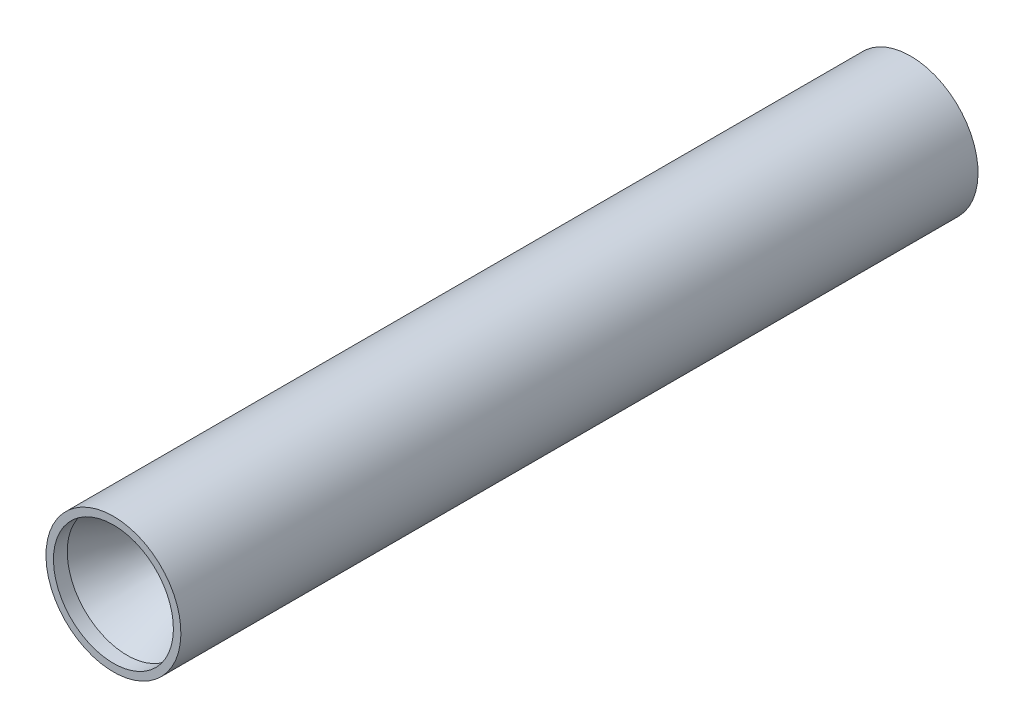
ISO-10303-21;
HEADER;
FILE_DESCRIPTION(('STEP AP214'),'2;1');
FILE_NAME('part.step','',(''),(''),'','','');
FILE_SCHEMA(('AUTOMOTIVE_DESIGN { 1 0 10303 214 1 1 1 1 }'));
ENDSEC;
DATA;
#1=APPLICATION_CONTEXT('core data for automotive mechanical design processes');
#2=APPLICATION_PROTOCOL_DEFINITION('international standard','automotive_design',2000,#1);
#3=PRODUCT_CONTEXT('',#1,'mechanical');
#4=PRODUCT('Part','Part','',(#3));
#5=PRODUCT_RELATED_PRODUCT_CATEGORY('part','',(#4));
#6=PRODUCT_DEFINITION_FORMATION('','',#4);
#7=PRODUCT_DEFINITION_CONTEXT('part definition',#1,'design');
#8=PRODUCT_DEFINITION('design','',#6,#7);
#9=PRODUCT_DEFINITION_SHAPE('','',#8);
#10=(LENGTH_UNIT() NAMED_UNIT(*) SI_UNIT(.MILLI.,.METRE.));
#11=(NAMED_UNIT(*) PLANE_ANGLE_UNIT() SI_UNIT($,.RADIAN.));
#12=(NAMED_UNIT(*) SI_UNIT($,.STERADIAN.) SOLID_ANGLE_UNIT());
#13=UNCERTAINTY_MEASURE_WITH_UNIT(LENGTH_MEASURE(1.E-05),#10,'distance_accuracy_value','');
#14=(GEOMETRIC_REPRESENTATION_CONTEXT(3) GLOBAL_UNCERTAINTY_ASSIGNED_CONTEXT((#13)) GLOBAL_UNIT_ASSIGNED_CONTEXT((#10,
#11,#12)) REPRESENTATION_CONTEXT('',''));
#15=CARTESIAN_POINT('',(0.,0.,0.));
#16=DIRECTION('',(0.,0.,1.));
#17=DIRECTION('',(1.,0.,0.));
#18=AXIS2_PLACEMENT_3D('',#15,#16,#17);
#19=CARTESIAN_POINT('',(0.,43.555023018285,289.5));
#20=DIRECTION('',(0.,0.,1.));
#21=DIRECTION('',(0.,-1.,0.));
#22=AXIS2_PLACEMENT_3D('',#19,#20,#21);
#23=PLANE('',#22);
#24=CARTESIAN_POINT('',(0.,0.,289.5));
#25=DIRECTION('',(0.,0.,-1.));
#26=DIRECTION('',(0.,1.,0.));
#27=AXIS2_PLACEMENT_3D('',#24,#25,#26);
#28=CIRCLE('',#27,43.555023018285);
#29=CARTESIAN_POINT('',(0.,43.555023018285,289.5));
#30=VERTEX_POINT('',#29);
#31=EDGE_CURVE('E75',#30,#30,#28,.T.);
#32=ORIENTED_EDGE('',*,*,#31,.T.);
#33=EDGE_LOOP('',(#32));
#34=FACE_BOUND('',#33,.T.);
#35=CARTESIAN_POINT('',(0.,0.,289.5));
#36=DIRECTION('',(0.,0.,-1.));
#37=DIRECTION('',(0.,1.,0.));
#38=AXIS2_PLACEMENT_3D('',#35,#36,#37);
#39=CIRCLE('',#38,49.);
#40=CARTESIAN_POINT('',(0.,49.,289.5));
#41=VERTEX_POINT('',#40);
#42=EDGE_CURVE('E10',#41,#41,#39,.T.);
#43=ORIENTED_EDGE('',*,*,#42,.F.);
#44=EDGE_LOOP('',(#43));
#45=FACE_BOUND('',#44,.T.);
#46=ADVANCED_FACE('F35',(#34,#45),#23,.T.);
#47=CARTESIAN_POINT('',(0.,0.,-279.5));
#48=DIRECTION('',(0.,0.,-1.));
#49=DIRECTION('',(0.,1.,0.));
#50=AXIS2_PLACEMENT_3D('',#47,#48,#49);
#51=CYLINDRICAL_SURFACE('',#50,49.);
#52=ORIENTED_EDGE('',*,*,#42,.T.);
#53=EDGE_LOOP('',(#52));
#54=FACE_BOUND('',#53,.T.);
#55=CARTESIAN_POINT('',(0.,0.,-289.5));
#56=DIRECTION('',(0.,0.,-1.));
#57=DIRECTION('',(0.,1.,0.));
#58=AXIS2_PLACEMENT_3D('',#55,#56,#57);
#59=CIRCLE('',#58,48.9999999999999);
#60=CARTESIAN_POINT('',(0.,49.,-289.5));
#61=VERTEX_POINT('',#60);
#62=EDGE_CURVE('E41',#61,#61,#59,.T.);
#63=ORIENTED_EDGE('',*,*,#62,.F.);
#64=EDGE_LOOP('',(#63));
#65=FACE_BOUND('',#64,.T.);
#66=ADVANCED_FACE('F93',(#54,#65),#51,.T.);
#67=CARTESIAN_POINT('',(0.,49.,-289.5));
#68=DIRECTION('',(0.,0.,-1.));
#69=DIRECTION('',(0.,1.,0.));
#70=AXIS2_PLACEMENT_3D('',#67,#68,#69);
#71=PLANE('',#70);
#72=ORIENTED_EDGE('',*,*,#62,.T.);
#73=EDGE_LOOP('',(#72));
#74=FACE_BOUND('',#73,.T.);
#75=CARTESIAN_POINT('',(0.,0.,-289.5));
#76=DIRECTION('',(0.,0.,-1.));
#77=DIRECTION('',(0.,1.,0.));
#78=AXIS2_PLACEMENT_3D('',#75,#76,#77);
#79=CIRCLE('',#78,10.);
#80=CARTESIAN_POINT('',(0.,10.0000000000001,-289.5));
#81=VERTEX_POINT('',#80);
#82=EDGE_CURVE('E45',#81,#81,#79,.T.);
#83=ORIENTED_EDGE('',*,*,#82,.F.);
#84=EDGE_LOOP('',(#83));
#85=FACE_BOUND('',#84,.T.);
#86=ADVANCED_FACE('F97',(#74,#85),#71,.T.);
#87=CARTESIAN_POINT('',(0.,0.,-279.5));
#88=DIRECTION('',(0.,0.,-1.));
#89=DIRECTION('',(0.,1.,0.));
#90=AXIS2_PLACEMENT_3D('',#87,#88,#89);
#91=CYLINDRICAL_SURFACE('',#90,10.);
#92=ORIENTED_EDGE('',*,*,#82,.T.);
#93=EDGE_LOOP('',(#92));
#94=FACE_BOUND('',#93,.T.);
#95=CARTESIAN_POINT('',(0.,0.,-279.5));
#96=DIRECTION('',(0.,0.,-1.));
#97=DIRECTION('',(0.,1.,0.));
#98=AXIS2_PLACEMENT_3D('',#95,#96,#97);
#99=CIRCLE('',#98,10.);
#100=CARTESIAN_POINT('',(0.,10.0000000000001,-279.5));
#101=VERTEX_POINT('',#100);
#102=EDGE_CURVE('E49',#101,#101,#99,.T.);
#103=ORIENTED_EDGE('',*,*,#102,.F.);
#104=EDGE_LOOP('',(#103));
#105=FACE_BOUND('',#104,.T.);
#106=ADVANCED_FACE('F101',(#94,#105),#91,.F.);
#107=CARTESIAN_POINT('',(0.,10.0000000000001,-279.5));
#108=DIRECTION('',(0.,0.,-1.));
#109=DIRECTION('',(0.,1.,0.));
#110=AXIS2_PLACEMENT_3D('',#107,#108,#109);
#111=PLANE('',#110);
#112=ORIENTED_EDGE('',*,*,#102,.T.);
#113=EDGE_LOOP('',(#112));
#114=FACE_BOUND('',#113,.T.);
#115=ADVANCED_FACE('F107',(#114),#111,.T.);
#116=CARTESIAN_POINT('',(0.,0.,-264.5));
#117=DIRECTION('',(0.,0.,1.));
#118=DIRECTION('',(0.,-1.,0.));
#119=AXIS2_PLACEMENT_3D('',#116,#117,#118);
#120=PLANE('',#119);
#121=CARTESIAN_POINT('',(0.,0.,-264.5));
#122=DIRECTION('',(0.,0.,-1.));
#123=DIRECTION('',(0.,1.,0.));
#124=AXIS2_PLACEMENT_3D('',#121,#122,#123);
#125=CIRCLE('',#124,35.2499999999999);
#126=CARTESIAN_POINT('',(0.,35.25,-264.5));
#127=VERTEX_POINT('',#126);
#128=EDGE_CURVE('E54',#127,#127,#125,.T.);
#129=ORIENTED_EDGE('',*,*,#128,.F.);
#130=EDGE_LOOP('',(#129));
#131=FACE_BOUND('',#130,.T.);
#132=ADVANCED_FACE('F111',(#131),#120,.T.);
#133=CARTESIAN_POINT('',(0.,0.,-279.5));
#134=DIRECTION('',(0.,0.,-1.));
#135=DIRECTION('',(0.,1.,0.));
#136=AXIS2_PLACEMENT_3D('',#133,#134,#135);
#137=CYLINDRICAL_SURFACE('',#136,35.2499999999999);
#138=ORIENTED_EDGE('',*,*,#128,.T.);
#139=EDGE_LOOP('',(#138));
#140=FACE_BOUND('',#139,.T.);
#141=CARTESIAN_POINT('',(0.,0.,169.5));
#142=DIRECTION('',(0.,0.,-1.));
#143=DIRECTION('',(0.,1.,0.));
#144=AXIS2_PLACEMENT_3D('',#141,#142,#143);
#145=CIRCLE('',#144,35.2499999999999);
#146=CARTESIAN_POINT('',(0.,35.2499999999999,169.5));
#147=VERTEX_POINT('',#146);
#148=EDGE_CURVE('E57',#147,#147,#145,.T.);
#149=ORIENTED_EDGE('',*,*,#148,.F.);
#150=EDGE_LOOP('',(#149));
#151=FACE_BOUND('',#150,.T.);
#152=ADVANCED_FACE('F115',(#140,#151),#137,.F.);
#153=CARTESIAN_POINT('',(0.,35.2499999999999,169.5));
#154=DIRECTION('',(0.,0.,1.));
#155=DIRECTION('',(0.,-1.,0.));
#156=AXIS2_PLACEMENT_3D('',#153,#154,#155);
#157=PLANE('',#156);
#158=ORIENTED_EDGE('',*,*,#148,.T.);
#159=EDGE_LOOP('',(#158));
#160=FACE_BOUND('',#159,.T.);
#161=CARTESIAN_POINT('',(0.,0.,169.5));
#162=DIRECTION('',(0.,0.,-1.));
#163=DIRECTION('',(0.,1.,0.));
#164=AXIS2_PLACEMENT_3D('',#161,#162,#163);
#165=CIRCLE('',#164,39.);
#166=CARTESIAN_POINT('',(0.,39.,169.5));
#167=VERTEX_POINT('',#166);
#168=EDGE_CURVE('E60',#167,#167,#165,.T.);
#169=ORIENTED_EDGE('',*,*,#168,.F.);
#170=EDGE_LOOP('',(#169));
#171=FACE_BOUND('',#170,.T.);
#172=ADVANCED_FACE('F119',(#160,#171),#157,.T.);
#173=CARTESIAN_POINT('',(0.,0.,-279.5));
#174=DIRECTION('',(0.,0.,-1.));
#175=DIRECTION('',(0.,1.,0.));
#176=AXIS2_PLACEMENT_3D('',#173,#174,#175);
#177=CYLINDRICAL_SURFACE('',#176,39.);
#178=ORIENTED_EDGE('',*,*,#168,.T.);
#179=EDGE_LOOP('',(#178));
#180=FACE_BOUND('',#179,.T.);
#181=CARTESIAN_POINT('',(0.,0.,179.5));
#182=DIRECTION('',(0.,0.,-1.));
#183=DIRECTION('',(0.,1.,0.));
#184=AXIS2_PLACEMENT_3D('',#181,#182,#183);
#185=CIRCLE('',#184,39.);
#186=CARTESIAN_POINT('',(0.,39.,179.5));
#187=VERTEX_POINT('',#186);
#188=EDGE_CURVE('E63',#187,#187,#185,.T.);
#189=ORIENTED_EDGE('',*,*,#188,.F.);
#190=EDGE_LOOP('',(#189));
#191=FACE_BOUND('',#190,.T.);
#192=ADVANCED_FACE('F123',(#180,#191),#177,.F.);
#193=CARTESIAN_POINT('',(0.,0.,204.5));
#194=DIRECTION('',(0.,0.,-1.));
#195=DIRECTION('',(0.,1.,0.));
#196=AXIS2_PLACEMENT_3D('',#193,#194,#195);
#197=CONICAL_SURFACE('',#196,14.,0.785398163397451);
#198=ORIENTED_EDGE('',*,*,#188,.T.);
#199=EDGE_LOOP('',(#198));
#200=FACE_BOUND('',#199,.T.);
#201=CARTESIAN_POINT('',(0.,0.,204.5));
#202=DIRECTION('',(0.,0.,-1.));
#203=DIRECTION('',(0.,1.,0.));
#204=AXIS2_PLACEMENT_3D('',#201,#202,#203);
#205=CIRCLE('',#204,14.);
#206=CARTESIAN_POINT('',(0.,14.,204.5));
#207=VERTEX_POINT('',#206);
#208=EDGE_CURVE('E66',#207,#207,#205,.T.);
#209=ORIENTED_EDGE('',*,*,#208,.F.);
#210=EDGE_LOOP('',(#209));
#211=FACE_BOUND('',#210,.T.);
#212=ADVANCED_FACE('F127',(#200,#211),#197,.F.);
#213=CARTESIAN_POINT('',(0.,0.,219.5));
#214=DIRECTION('',(0.,0.,1.));
#215=DIRECTION('',(0.,-1.,0.));
#216=AXIS2_PLACEMENT_3D('',#213,#214,#215);
#217=CONICAL_SURFACE('',#216,15.576563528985,0.104719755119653);
#218=ORIENTED_EDGE('',*,*,#208,.T.);
#219=EDGE_LOOP('',(#218));
#220=FACE_BOUND('',#219,.T.);
#221=CARTESIAN_POINT('',(0.,0.,219.5));
#222=DIRECTION('',(0.,0.,-1.));
#223=DIRECTION('',(0.,1.,0.));
#224=AXIS2_PLACEMENT_3D('',#221,#222,#223);
#225=CIRCLE('',#224,15.576563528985);
#226=CARTESIAN_POINT('',(0.,15.576563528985,219.5));
#227=VERTEX_POINT('',#226);
#228=EDGE_CURVE('E69',#227,#227,#225,.T.);
#229=ORIENTED_EDGE('',*,*,#228,.F.);
#230=EDGE_LOOP('',(#229));
#231=FACE_BOUND('',#230,.T.);
#232=ADVANCED_FACE('F89',(#220,#231),#217,.F.);
#233=CARTESIAN_POINT('',(0.,0.,279.5));
#234=DIRECTION('',(0.,0.,1.));
#235=DIRECTION('',(0.,-1.,0.));
#236=AXIS2_PLACEMENT_3D('',#233,#234,#235);
#237=CONICAL_SURFACE('',#236,43.555023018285,0.436332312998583);
#238=ORIENTED_EDGE('',*,*,#228,.T.);
#239=EDGE_LOOP('',(#238));
#240=FACE_BOUND('',#239,.T.);
#241=CARTESIAN_POINT('',(0.,0.,279.5));
#242=DIRECTION('',(0.,0.,-1.));
#243=DIRECTION('',(0.,1.,0.));
#244=AXIS2_PLACEMENT_3D('',#241,#242,#243);
#245=CIRCLE('',#244,43.555023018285);
#246=CARTESIAN_POINT('',(0.,43.555023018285,279.5));
#247=VERTEX_POINT('',#246);
#248=EDGE_CURVE('E72',#247,#247,#245,.T.);
#249=ORIENTED_EDGE('',*,*,#248,.F.);
#250=EDGE_LOOP('',(#249));
#251=FACE_BOUND('',#250,.T.);
#252=ADVANCED_FACE('F83',(#240,#251),#237,.F.);
#253=CARTESIAN_POINT('',(0.,0.,-279.5));
#254=DIRECTION('',(0.,0.,-1.));
#255=DIRECTION('',(0.,1.,0.));
#256=AXIS2_PLACEMENT_3D('',#253,#254,#255);
#257=CYLINDRICAL_SURFACE('',#256,43.555023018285);
#258=ORIENTED_EDGE('',*,*,#248,.T.);
#259=EDGE_LOOP('',(#258));
#260=FACE_BOUND('',#259,.T.);
#261=ORIENTED_EDGE('',*,*,#31,.F.);
#262=EDGE_LOOP('',(#261));
#263=FACE_BOUND('',#262,.T.);
#264=ADVANCED_FACE('F81',(#260,#263),#257,.F.);
#265=CLOSED_SHELL('',(#46,#66,#86,#106,#115,#132,#152,#172,#192,#212,#232,#252,#264));
#266=MANIFOLD_SOLID_BREP('B2',#265);
#267=ADVANCED_BREP_SHAPE_REPRESENTATION('',(#18,#266),#14);
#268=SHAPE_DEFINITION_REPRESENTATION(#9,#267);
ENDSEC;
END-ISO-10303-21;
